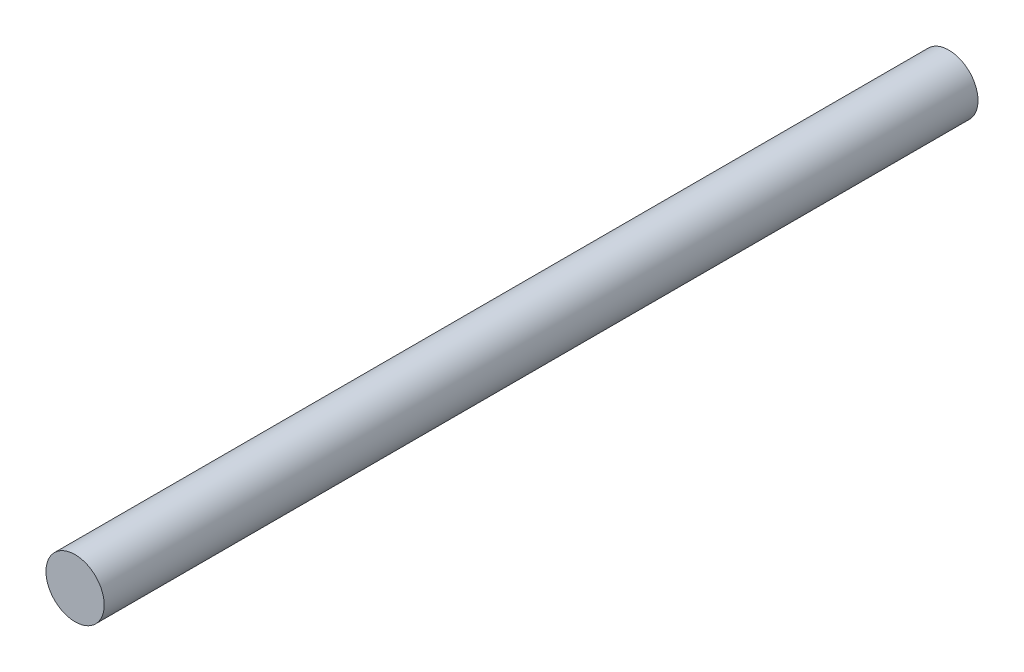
from build123d import *

# Parameters (mm, degrees)
SKETCH1_R           = 25.4
BOSS_EXTRUDE1_DEPTH = 762


with BuildPart() as part:
    # Sketch1 → Boss-Extrude1 (new body)
    with BuildSketch(Plane(origin=(0, 0, 0), x_dir=(0, 1, 0), z_dir=(0, 0, 1))):
        with Locations(Location((0, 0, 0), (0, 0, 270))):
            Circle(SKETCH1_R)
    extrude(amount=-BOSS_EXTRUDE1_DEPTH)


solid = part.part
